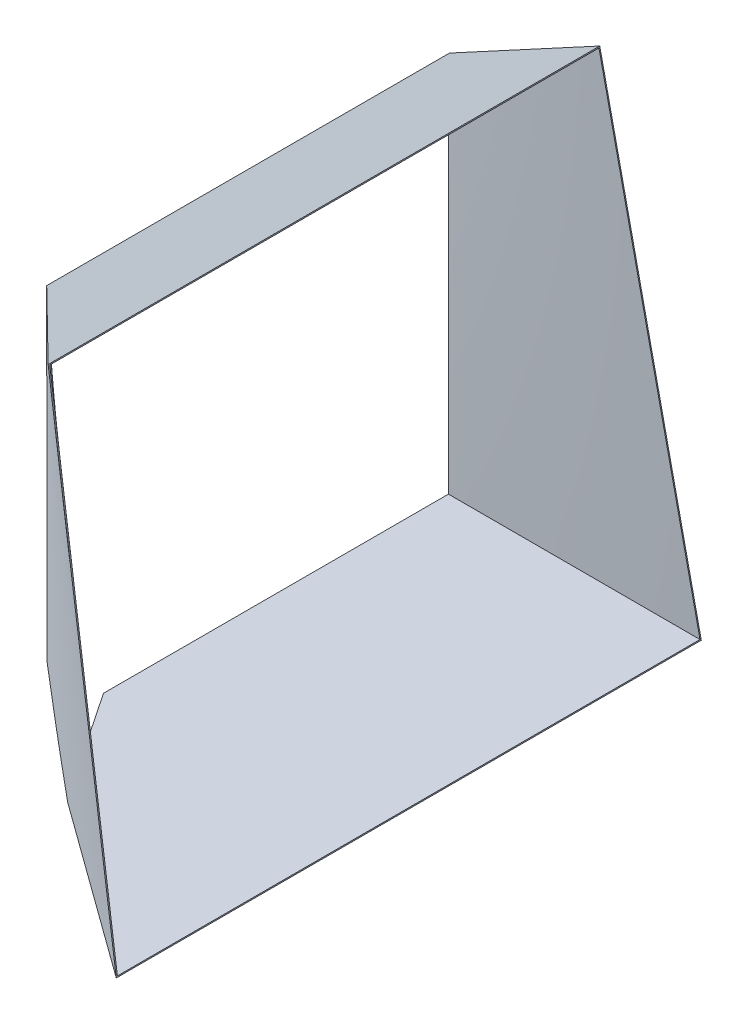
ISO-10303-21;
HEADER;
FILE_DESCRIPTION(('STEP AP214'),'2;1');
FILE_NAME('part.step','',(''),(''),'','','');
FILE_SCHEMA(('AUTOMOTIVE_DESIGN { 1 0 10303 214 1 1 1 1 }'));
ENDSEC;
DATA;
#1=APPLICATION_CONTEXT('core data for automotive mechanical design processes');
#2=APPLICATION_PROTOCOL_DEFINITION('international standard','automotive_design',2000,#1);
#3=PRODUCT_CONTEXT('',#1,'mechanical');
#4=PRODUCT('Part','Part','',(#3));
#5=PRODUCT_RELATED_PRODUCT_CATEGORY('part','',(#4));
#6=PRODUCT_DEFINITION_FORMATION('','',#4);
#7=PRODUCT_DEFINITION_CONTEXT('part definition',#1,'design');
#8=PRODUCT_DEFINITION('design','',#6,#7);
#9=PRODUCT_DEFINITION_SHAPE('','',#8);
#10=(LENGTH_UNIT() NAMED_UNIT(*) SI_UNIT(.MILLI.,.METRE.));
#11=(NAMED_UNIT(*) PLANE_ANGLE_UNIT() SI_UNIT($,.RADIAN.));
#12=(NAMED_UNIT(*) SI_UNIT($,.STERADIAN.) SOLID_ANGLE_UNIT());
#13=UNCERTAINTY_MEASURE_WITH_UNIT(LENGTH_MEASURE(1.E-05),#10,'distance_accuracy_value','');
#14=(GEOMETRIC_REPRESENTATION_CONTEXT(3) GLOBAL_UNCERTAINTY_ASSIGNED_CONTEXT((#13)) GLOBAL_UNIT_ASSIGNED_CONTEXT((#10,
#11,#12)) REPRESENTATION_CONTEXT('',''));
#15=CARTESIAN_POINT('',(0.,0.,0.));
#16=DIRECTION('',(0.,0.,1.));
#17=DIRECTION('',(1.,0.,0.));
#18=AXIS2_PLACEMENT_3D('',#15,#16,#17);
#19=CARTESIAN_POINT('',(880.883595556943,197.394847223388,234.644425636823));
#20=DIRECTION('',(1.,0.,0.));
#21=DIRECTION('',(0.,0.,-1.));
#22=AXIS2_PLACEMENT_3D('',#19,#20,#21);
#23=PLANE('',#22);
#24=DIRECTION('',(0.,0.,1.));
#25=VECTOR('',#24,1.);
#26=CARTESIAN_POINT('',(880.883595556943,197.394847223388,234.644425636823));
#27=LINE('',#26,#25);
#28=CARTESIAN_POINT('',(880.883595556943,197.394847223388,-525.355574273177));
#29=VERTEX_POINT('',#28);
#30=CARTESIAN_POINT('',(880.883595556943,197.394847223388,129.644425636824));
#31=VERTEX_POINT('',#30);
#32=EDGE_CURVE('E140',#29,#31,#27,.T.);
#33=ORIENTED_EDGE('',*,*,#32,.F.);
#34=DIRECTION('',(0.,-1.,0.));
#35=VECTOR('',#34,1.);
#36=CARTESIAN_POINT('',(880.883595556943,197.394847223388,-525.355574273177));
#37=LINE('',#36,#35);
#38=CARTESIAN_POINT('',(880.883595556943,919.394847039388,-525.355574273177));
#39=VERTEX_POINT('',#38);
#40=EDGE_CURVE('E264',#39,#29,#37,.T.);
#41=ORIENTED_EDGE('',*,*,#40,.F.);
#42=DIRECTION('',(0.,0.,-1.));
#43=VECTOR('',#42,1.);
#44=CARTESIAN_POINT('',(880.883595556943,919.394847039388,-525.355574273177));
#45=LINE('',#44,#43);
#46=CARTESIAN_POINT('',(880.883595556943,919.394847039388,234.644425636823));
#47=VERTEX_POINT('',#46);
#48=EDGE_CURVE('E138',#47,#39,#45,.T.);
#49=ORIENTED_EDGE('',*,*,#48,.F.);
#50=DIRECTION('',(0.,1.,0.));
#51=VECTOR('',#50,1.);
#52=CARTESIAN_POINT('',(880.883595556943,919.394847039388,234.644425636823));
#53=LINE('',#52,#51);
#54=CARTESIAN_POINT('',(880.883595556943,302.394847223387,234.644425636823));
#55=VERTEX_POINT('',#54);
#56=EDGE_CURVE('E124',#55,#47,#53,.T.);
#57=ORIENTED_EDGE('',*,*,#56,.F.);
#58=DIRECTION('',(0.,0.707106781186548,0.707106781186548));
#59=VECTOR('',#58,1.);
#60=CARTESIAN_POINT('',(880.883595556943,249.894847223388,182.144425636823));
#61=LINE('',#60,#59);
#62=CARTESIAN_POINT('',(880.883595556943,304.886968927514,237.13654734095));
#63=VERTEX_POINT('',#62);
#64=EDGE_CURVE('E135',#55,#63,#61,.T.);
#65=ORIENTED_EDGE('',*,*,#64,.T.);
#66=CARTESIAN_POINT('',(880.883595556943,304.886968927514,237.136547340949));
#67=CARTESIAN_POINT('',(880.883595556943,330.587160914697,237.145022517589));
#68=CARTESIAN_POINT('',(880.883595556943,356.287352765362,237.153901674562));
#69=CARTESIAN_POINT('',(880.883595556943,407.687736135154,237.172598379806));
#70=CARTESIAN_POINT('',(880.883595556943,433.387927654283,237.182415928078));
#71=CARTESIAN_POINT('',(880.883595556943,510.488500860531,237.213471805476));
#72=CARTESIAN_POINT('',(880.883595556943,561.888881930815,237.236313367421));
#73=CARTESIAN_POINT('',(880.883595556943,638.989452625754,237.274906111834));
#74=CARTESIAN_POINT('',(880.883595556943,664.689643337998,237.288492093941));
#75=CARTESIAN_POINT('',(880.883595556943,716.090023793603,237.317366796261));
#76=CARTESIAN_POINT('',(880.883595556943,741.790213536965,237.332655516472));
#77=CARTESIAN_POINT('',(880.883595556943,793.190592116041,237.365234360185));
#78=CARTESIAN_POINT('',(880.883595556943,818.890780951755,237.382524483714));
#79=CARTESIAN_POINT('',(880.883595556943,870.291156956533,237.419506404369));
#80=CARTESIAN_POINT('',(880.883595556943,895.991344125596,237.439198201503));
#81=CARTESIAN_POINT('',(880.883595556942,921.691530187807,237.460290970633));
#82=B_SPLINE_CURVE_WITH_KNOTS('',3,(#66,#67,#68,#69,#70,#71,#72,#73,#74,#75,#76,#77,#78,#79,#80,
#81),.UNSPECIFIED.,.F.,.F.,(4,2,2,2,2,2,2,4),(0.,77.100580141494,154.20116031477,
308.402318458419,385.502901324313,462.603484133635,539.704067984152,616.804652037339),.UNSPECIFIED.);
#83=CARTESIAN_POINT('',(880.883595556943,921.691530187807,237.460290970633));
#84=VERTEX_POINT('',#83);
#85=EDGE_CURVE('E151',#63,#84,#82,.T.);
#86=ORIENTED_EDGE('',*,*,#85,.T.);
#87=DIRECTION('',(0.,0.,-1.));
#88=VECTOR('',#87,1.);
#89=CARTESIAN_POINT('',(880.883595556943,921.691530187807,-509.775661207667));
#90=LINE('',#89,#88);
#91=CARTESIAN_POINT('',(880.883595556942,921.691530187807,-527.358290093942));
#92=VERTEX_POINT('',#91);
#93=EDGE_CURVE('E300',#84,#92,#90,.T.);
#94=ORIENTED_EDGE('',*,*,#93,.T.);
#95=CARTESIAN_POINT('',(880.883595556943,921.691530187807,-527.358290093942));
#96=CARTESIAN_POINT('',(880.883595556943,883.16223744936,-527.357559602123));
#97=CARTESIAN_POINT('',(880.883595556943,844.63294470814,-527.357023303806));
#98=CARTESIAN_POINT('',(880.883595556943,767.574359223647,-527.356234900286));
#99=CARTESIAN_POINT('',(880.883595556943,729.045066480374,-527.355982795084));
#100=CARTESIAN_POINT('',(880.883595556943,649.25559123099,-527.355647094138));
#101=CARTESIAN_POINT('',(880.883595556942,607.99540872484,-527.355576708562));
#102=CARTESIAN_POINT('',(880.883595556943,525.475043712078,-527.355571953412));
#103=CARTESIAN_POINT('',(880.883595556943,484.214861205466,-527.355637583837));
#104=CARTESIAN_POINT('',(880.883595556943,401.694496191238,-527.355855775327));
#105=CARTESIAN_POINT('',(880.883595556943,360.434313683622,-527.356008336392));
#106=CARTESIAN_POINT('',(880.883595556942,277.913948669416,-527.356371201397));
#107=CARTESIAN_POINT('',(880.883595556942,236.653766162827,-527.356581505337));
#108=CARTESIAN_POINT('',(880.883595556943,195.39358365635,-527.356806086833));
#109=B_SPLINE_CURVE_WITH_KNOTS('',3,(#95,#96,#97,#98,#99,#100,#101,#102,#103,#104,#105,#106,
#107,#108),.UNSPECIFIED.,.F.,.F.,(4,2,2,2,2,2,4),(0.,115.587878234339,231.17575646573,
354.956303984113,478.736851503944,602.517399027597,726.29794654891),.UNSPECIFIED.);
#110=CARTESIAN_POINT('',(880.883595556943,195.39358365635,-527.356806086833));
#111=VERTEX_POINT('',#110);
#112=EDGE_CURVE('E295',#92,#111,#109,.T.);
#113=ORIENTED_EDGE('',*,*,#112,.T.);
#114=DIRECTION('',(0.,0.,1.));
#115=VECTOR('',#114,1.);
#116=CARTESIAN_POINT('',(880.883595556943,195.39358365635,234.644425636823));
#117=LINE('',#116,#115);
#118=CARTESIAN_POINT('',(880.883595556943,195.39358365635,127.643162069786));
#119=VERTEX_POINT('',#118);
#120=EDGE_CURVE('E293',#111,#119,#117,.T.);
#121=ORIENTED_EDGE('',*,*,#120,.T.);
#122=EDGE_CURVE('E148',#119,#31,#61,.T.);
#123=ORIENTED_EDGE('',*,*,#122,.T.);
#124=EDGE_LOOP('',(#33,#41,#49,#57,#65,#86,#94,#113,#121,#123));
#125=FACE_BOUND('',#124,.T.);
#126=ADVANCED_FACE('F41',(#125),#23,.F.);
#127=CARTESIAN_POINT('',(1182.25054398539,1089.52399568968,533.064512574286));
#128=DIRECTION('',(-0.984807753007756,-0.173648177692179,0.));
#129=DIRECTION('',(0.173648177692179,-0.984807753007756,0.));
#130=AXIS2_PLACEMENT_3D('',#127,#128,#129);
#131=PLANE('',#130);
#132=CARTESIAN_POINT('',(1181.88223828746,1091.61276109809,535.719743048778));
#133=CARTESIAN_POINT('',(1190.09758456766,1045.02121710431,537.326306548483));
#134=CARTESIAN_POINT('',(1198.31292280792,998.429718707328,538.934232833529));
#135=CARTESIAN_POINT('',(1214.74358557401,905.246799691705,542.152406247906));
#136=CARTESIAN_POINT('',(1222.95891009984,858.655379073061,543.762653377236));
#137=CARTESIAN_POINT('',(1239.38954781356,765.472602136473,546.985063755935));
#138=CARTESIAN_POINT('',(1247.60486100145,718.881245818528,548.597227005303));
#139=CARTESIAN_POINT('',(1264.03547780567,625.698587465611,551.82317086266));
#140=CARTESIAN_POINT('',(1272.25078142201,579.107285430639,553.43695147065));
#141=CARTESIAN_POINT('',(1290.85600733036,473.591806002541,557.093232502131));
#142=CARTESIAN_POINT('',(1301.24592719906,414.667642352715,559.136141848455));
#143=CARTESIAN_POINT('',(1322.025756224,296.819375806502,563.223764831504));
#144=CARTESIAN_POINT('',(1332.41566538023,237.895272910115,565.268478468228));
#145=CARTESIAN_POINT('',(1342.80557030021,178.971194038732,567.313905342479));
#146=B_SPLINE_CURVE_WITH_KNOTS('',3,(#132,#133,#134,#135,#136,#137,#138,#139,#140,#141,#142,
#143,#144,#145),.UNSPECIFIED.,.F.,.F.,(4,2,2,2,2,2,4),(0.,142.012690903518,284.025381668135,
426.038072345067,568.050763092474,747.654852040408,927.258940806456),.UNSPECIFIED.);
#147=CARTESIAN_POINT('',(1181.88223828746,1091.61276109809,535.719743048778));
#148=VERTEX_POINT('',#147);
#149=CARTESIAN_POINT('',(1342.80557030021,178.971194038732,567.313905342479));
#150=VERTEX_POINT('',#149);
#151=EDGE_CURVE('E308',#148,#150,#146,.T.);
#152=ORIENTED_EDGE('',*,*,#151,.T.);
#153=DIRECTION('',(0.,0.,-1.));
#154=VECTOR('',#153,1.);
#155=CARTESIAN_POINT('',(1342.80557030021,178.971194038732,533.064512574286));
#156=LINE('',#155,#154);
#157=CARTESIAN_POINT('',(1342.80557030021,178.971194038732,-543.557840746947));
#158=VERTEX_POINT('',#157);
#159=EDGE_CURVE('E52',#150,#158,#156,.T.);
#160=ORIENTED_EDGE('',*,*,#159,.T.);
#161=CARTESIAN_POINT('',(1342.80557030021,178.971194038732,-543.557840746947));
#162=CARTESIAN_POINT('',(1329.43238600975,254.814290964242,-540.910542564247));
#163=CARTESIAN_POINT('',(1316.05920158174,330.657388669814,-538.263267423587));
#164=CARTESIAN_POINT('',(1289.31283213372,482.343587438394,-532.96881632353));
#165=CARTESIAN_POINT('',(1275.93964711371,558.186688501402,-530.321640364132));
#166=CARTESIAN_POINT('',(1249.11909245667,710.293612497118,-525.012756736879));
#167=CARTESIAN_POINT('',(1235.67172281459,786.5574354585,-522.351049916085));
#168=CARTESIAN_POINT('',(1208.77698192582,939.085090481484,-517.027905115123));
#169=CARTESIAN_POINT('',(1195.32961067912,1015.34892254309,-514.366467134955));
#170=CARTESIAN_POINT('',(1181.88223828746,1091.61276109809,-511.705221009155));
#171=B_SPLINE_CURVE_WITH_KNOTS('',3,(#161,#162,#163,#164,#165,#166,#167,#168,#169,#170),
.UNSPECIFIED.,.F.,.F.,(4,2,2,2,4),(0.,231.175756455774,462.35151291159,694.809647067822,
927.267781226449),.UNSPECIFIED.);
#172=CARTESIAN_POINT('',(1181.88223828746,1091.61276109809,-511.705221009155));
#173=VERTEX_POINT('',#172);
#174=EDGE_CURVE('E316',#158,#173,#171,.T.);
#175=ORIENTED_EDGE('',*,*,#174,.T.);
#176=DIRECTION('',(0.,0.,1.));
#177=VECTOR('',#176,1.);
#178=CARTESIAN_POINT('',(1181.88223828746,1091.61276109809,-509.775661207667));
#179=LINE('',#178,#177);
#180=EDGE_CURVE('E314',#173,#148,#179,.T.);
#181=ORIENTED_EDGE('',*,*,#180,.T.);
#182=EDGE_LOOP('',(#152,#160,#175,#181));
#183=FACE_BOUND('',#182,.T.);
#184=DIRECTION('',(0.17354569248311,-0.98422653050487,0.0343515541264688));
#185=VECTOR('',#184,1.);
#186=CARTESIAN_POINT('',(1342.45046745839,180.985082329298,564.774411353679));
#187=LINE('',#186,#185);
#188=CARTESIAN_POINT('',(1182.25054398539,1089.52399568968,533.064512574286));
#189=VERTEX_POINT('',#188);
#190=CARTESIAN_POINT('',(1342.45046745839,180.985082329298,564.774411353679));
#191=VERTEX_POINT('',#190);
#192=EDGE_CURVE('E250',#189,#191,#187,.T.);
#193=ORIENTED_EDGE('',*,*,#192,.F.);
#194=DIRECTION('',(0.,0.,1.));
#195=VECTOR('',#194,1.);
#196=CARTESIAN_POINT('',(1182.25054398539,1089.52399568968,533.064512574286));
#197=LINE('',#196,#195);
#198=CARTESIAN_POINT('',(1182.25054398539,1089.52399568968,-509.775661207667));
#199=VERTEX_POINT('',#198);
#200=EDGE_CURVE('E281',#199,#189,#197,.T.);
#201=ORIENTED_EDGE('',*,*,#200,.F.);
#202=DIRECTION('',(-0.17354569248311,0.98422653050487,0.0343515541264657));
#203=VECTOR('',#202,1.);
#204=CARTESIAN_POINT('',(1182.25054398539,1089.52399568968,-509.775661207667));
#205=LINE('',#204,#203);
#206=CARTESIAN_POINT('',(1342.45046745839,180.985082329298,-541.485559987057));
#207=VERTEX_POINT('',#206);
#208=EDGE_CURVE('E283',#207,#199,#205,.T.);
#209=ORIENTED_EDGE('',*,*,#208,.F.);
#210=DIRECTION('',(0.,0.,-1.));
#211=VECTOR('',#210,1.);
#212=CARTESIAN_POINT('',(1342.45046745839,180.985082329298,-541.485559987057));
#213=LINE('',#212,#211);
#214=EDGE_CURVE('E287',#191,#207,#213,.T.);
#215=ORIENTED_EDGE('',*,*,#214,.F.);
#216=EDGE_LOOP('',(#193,#201,#209,#215));
#217=FACE_BOUND('',#216,.T.);
#218=ADVANCED_FACE('F186',(#183,#217),#131,.F.);
#219=CARTESIAN_POINT('',(1348.76590371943,171.713716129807,568.454304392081));
#220=CARTESIAN_POINT('',(880.883595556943,190.174847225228,234.644425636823));
#221=CARTESIAN_POINT('',(1348.22646972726,174.748506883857,568.347529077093));
#222=CARTESIAN_POINT('',(880.883595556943,192.581513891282,234.644425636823));
#223=CARTESIAN_POINT('',(1347.68703573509,177.783297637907,568.240753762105));
#224=CARTESIAN_POINT('',(880.883595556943,194.988180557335,234.644425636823));
#225=CARTESIAN_POINT('',(1320.17590213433,332.557626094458,562.795212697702));
#226=CARTESIAN_POINT('',(880.883595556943,317.728180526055,234.644425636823));
#227=CARTESIAN_POINT('',(1293.20420252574,484.297163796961,557.456446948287));
#228=CARTESIAN_POINT('',(880.883595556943,438.061513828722,234.644425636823));
#229=CARTESIAN_POINT('',(1239.26080330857,787.77623920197,546.778915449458));
#230=CARTESIAN_POINT('',(880.883595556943,678.728180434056,234.644425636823));
#231=CARTESIAN_POINT('',(1212.28910369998,939.515776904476,541.440149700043));
#232=CARTESIAN_POINT('',(880.883595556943,799.061513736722,234.644425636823));
#233=CARTESIAN_POINT('',(1184.77797009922,1094.29010536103,535.99460863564));
#234=CARTESIAN_POINT('',(880.883595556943,921.801513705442,234.644425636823));
#235=CARTESIAN_POINT('',(1184.23853610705,1097.32489611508,535.887833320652));
#236=CARTESIAN_POINT('',(880.883595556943,924.208180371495,234.644425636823));
#237=CARTESIAN_POINT('',(1183.69910211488,1100.35968686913,535.781058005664));
#238=CARTESIAN_POINT('',(880.883595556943,926.614847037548,234.644425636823));
#239=B_SPLINE_SURFACE_WITH_KNOTS('',3,1,((#219,#220),(#221,#222),(#223,#224),(#225,#226),(#227,
#228),(#229,#230),(#231,#232),(#233,#234),(#235,#236),(#237,#238)),.UNSPECIFIED.,.F.,.F.,.F.,(4,
2,2,2,4),(2,2),(-0.01,0.,0.5,1.,1.01),(-0.0101764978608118,1.),.UNSPECIFIED.);
#240=OFFSET_SURFACE('',#239,2.,.F.);
#241=CARTESIAN_POINT('',(753.481187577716,402.705865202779,138.360462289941));
#242=CARTESIAN_POINT('',(758.86887118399,398.761682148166,142.730027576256));
#243=CARTESIAN_POINT('',(764.257510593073,394.789652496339,147.073221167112));
#244=CARTESIAN_POINT('',(775.035519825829,386.792946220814,155.708088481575));
#245=CARTESIAN_POINT('',(780.424889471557,382.768276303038,159.999768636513));
#246=CARTESIAN_POINT('',(791.204102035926,374.668666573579,168.533589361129));
#247=CARTESIAN_POINT('',(796.593944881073,370.593730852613,172.775733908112));
#248=CARTESIAN_POINT('',(807.373864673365,362.395779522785,181.212304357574));
#249=CARTESIAN_POINT('',(812.763941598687,358.272766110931,185.406732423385));
#250=CARTESIAN_POINT('',(823.544087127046,349.980737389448,193.749573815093));
#251=CARTESIAN_POINT('',(828.934155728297,345.811722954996,197.897988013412));
#252=CARTESIAN_POINT('',(839.714044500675,337.429652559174,206.15039152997));
#253=CARTESIAN_POINT('',(845.103864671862,333.216596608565,210.254380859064));
#254=CARTESIAN_POINT('',(855.875519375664,324.754190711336,218.413742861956));
#255=CARTESIAN_POINT('',(861.257354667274,320.50489885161,222.469174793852));
#256=CARTESIAN_POINT('',(872.02031705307,311.965989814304,230.538620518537));
#257=CARTESIAN_POINT('',(877.40144413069,307.676371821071,234.55263347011));
#258=CARTESIAN_POINT('',(888.16275332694,299.058477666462,242.540543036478));
#259=CARTESIAN_POINT('',(893.542935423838,294.730200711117,246.514438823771));
#260=CARTESIAN_POINT('',(904.302115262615,286.036578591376,254.423334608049));
#261=CARTESIAN_POINT('',(909.681112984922,281.671232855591,258.358334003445));
#262=CARTESIAN_POINT('',(920.437682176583,272.904992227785,266.190582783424));
#263=CARTESIAN_POINT('',(925.815253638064,268.50409714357,270.087831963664));
#264=CARTESIAN_POINT('',(936.568726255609,259.668211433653,277.845657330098));
#265=CARTESIAN_POINT('',(941.944627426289,255.233221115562,281.706233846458));
#266=CARTESIAN_POINT('',(952.642430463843,246.373671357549,289.35449129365));
#267=CARTESIAN_POINT('',(957.964349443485,241.949429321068,293.142516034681));
#268=CARTESIAN_POINT('',(968.606238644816,233.070029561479,300.684642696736));
#269=CARTESIAN_POINT('',(973.92620889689,228.614872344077,304.438745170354));
#270=CARTESIAN_POINT('',(984.564140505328,219.674735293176,311.91402756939));
#271=CARTESIAN_POINT('',(989.88210187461,215.18975565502,315.635207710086));
#272=CARTESIAN_POINT('',(1000.51595219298,206.191018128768,323.045591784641));
#273=CARTESIAN_POINT('',(1005.83184114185,201.677260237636,326.734795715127));
#274=CARTESIAN_POINT('',(1016.46147980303,192.621965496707,334.08212355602));
#275=CARTESIAN_POINT('',(1021.77522950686,188.080428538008,337.740247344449));
#276=CARTESIAN_POINT('',(1032.40051982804,178.970533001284,345.026264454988));
#277=CARTESIAN_POINT('',(1037.71206043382,174.402174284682,348.654157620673));
#278=CARTESIAN_POINT('',(1048.34016867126,165.2332481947,355.885492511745));
#279=CARTESIAN_POINT('',(1053.65673312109,160.632645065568,359.488893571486));
#280=CARTESIAN_POINT('',(1064.28749955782,151.406348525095,366.666959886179));
#281=CARTESIAN_POINT('',(1069.60170154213,146.780655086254,370.241625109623));
#282=CARTESIAN_POINT('',(1080.22766186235,137.505031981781,377.362948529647));
#283=CARTESIAN_POINT('',(1085.5394202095,132.855102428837,380.909606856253));
#284=CARTESIAN_POINT('',(1096.16040888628,123.531829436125,387.975608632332));
#285=CARTESIAN_POINT('',(1101.46963924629,118.858486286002,391.494952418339));
#286=CARTESIAN_POINT('',(1112.08548415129,109.48918176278,398.506985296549));
#287=CARTESIAN_POINT('',(1117.39209875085,104.793220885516,401.999674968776));
#288=CARTESIAN_POINT('',(1128.00262285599,95.3794403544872,408.959021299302));
#289=CARTESIAN_POINT('',(1133.30653244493,90.6616214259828,412.425678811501));
#290=CARTESIAN_POINT('',(1138.60916174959,85.9331490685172,415.879707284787));
#291=B_SPLINE_CURVE_WITH_KNOTS('',3,(#241,#242,#243,#244,#245,#246,#247,#248,#249,#250,#251,
#252,#253,#254,#255,#256,#257,#258,#259,#260,#261,#262,#263,#264,#265,#266,#267,#268,#269,#270,
#271,#272,#273,#274,#275,#276,#277,#278,#279,#280,#281,#282,#283,#284,#285,#286,#287,#288,#289,
#290),.UNSPECIFIED.,.F.,.F.,(4,2,2,2,2,2,2,2,2,2,2,2,2,2,2,2,2,2,2,2,2,2,2,2,4),(0.,
23.9391878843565,47.8753552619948,71.8095873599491,95.7427299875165,119.675418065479,
143.608100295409,167.507766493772,191.407917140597,215.308559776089,239.20957149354,
263.11071251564,287.011638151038,310.680315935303,334.348607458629,358.016744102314,
381.684883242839,405.353115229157,429.021469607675,452.722495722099,476.423547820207,
500.124489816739,523.825139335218,547.525271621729,571.224623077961),.UNSPECIFIED.);
#292=CARTESIAN_POINT('',(1018.95784702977,190.484726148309,335.797034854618));
#293=VERTEX_POINT('',#292);
#294=EDGE_CURVE('E146',#293,#63,#291,.F.);
#295=ORIENTED_EDGE('',*,*,#294,.F.);
#296=CARTESIAN_POINT('',(1018.95784702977,190.484726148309,335.797034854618));
#297=CARTESIAN_POINT('',(1038.20493978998,189.800447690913,349.555392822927));
#298=CARTESIAN_POINT('',(1057.45190519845,189.116173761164,363.313929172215));
#299=CARTESIAN_POINT('',(1095.94560375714,187.747634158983,390.831327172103));
#300=CARTESIAN_POINT('',(1115.19233690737,187.06336848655,404.590188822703));
#301=CARTESIAN_POINT('',(1169.16734853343,185.144432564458,443.175786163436));
#302=CARTESIAN_POINT('',(1203.89539037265,183.909770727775,468.002853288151));
#303=CARTESIAN_POINT('',(1273.35089181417,181.440467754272,517.657803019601));
#304=CARTESIAN_POINT('',(1308.07835141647,180.205826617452,542.485685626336));
#305=CARTESIAN_POINT('',(1342.80557030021,178.971194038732,567.313905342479));
#306=B_SPLINE_CURVE_WITH_KNOTS('',3,(#296,#297,#298,#299,#300,#301,#302,#303,#304,#305),
.UNSPECIFIED.,.F.,.F.,(4,2,2,2,4),(0.,71.0063453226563,142.012690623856,270.135681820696,
398.258673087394),.UNSPECIFIED.);
#307=EDGE_CURVE('E164',#293,#150,#306,.T.);
#308=ORIENTED_EDGE('',*,*,#307,.T.);
#309=ORIENTED_EDGE('',*,*,#151,.F.);
#310=CARTESIAN_POINT('',(1181.88223828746,1091.61276109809,535.719743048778));
#311=CARTESIAN_POINT('',(1166.27640756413,1082.80288095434,520.258330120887));
#312=CARTESIAN_POINT('',(1150.67070138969,1073.99307112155,504.796751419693));
#313=CARTESIAN_POINT('',(1119.4595679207,1056.37360889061,473.873222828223));
#314=CARTESIAN_POINT('',(1103.85414062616,1047.56395649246,458.411272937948));
#315=CARTESIAN_POINT('',(1053.68617106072,1019.24288811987,408.703399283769));
#316=CARTESIAN_POINT('',(1019.12423153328,999.731812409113,374.456673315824));
#317=CARTESIAN_POINT('',(967.282785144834,970.466024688,323.084637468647));
#318=CARTESIAN_POINT('',(950.002546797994,960.710899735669,305.960301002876));
#319=CARTESIAN_POINT('',(915.442631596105,941.20096680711,271.710880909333));
#320=CARTESIAN_POINT('',(898.162954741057,931.446158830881,254.585797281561));
#321=CARTESIAN_POINT('',(880.883595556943,921.691530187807,237.460290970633));
#322=B_SPLINE_CURVE_WITH_KNOTS('',3,(#310,#311,#312,#313,#314,#315,#316,#317,#318,#319,#320,
#321),.UNSPECIFIED.,.F.,.F.,(4,2,2,2,2,4),(0.,71.0063453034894,142.012690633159,299.27817246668,
377.910913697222,456.543654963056),.UNSPECIFIED.);
#323=EDGE_CURVE('E172',#148,#84,#322,.T.);
#324=ORIENTED_EDGE('',*,*,#323,.T.);
#325=ORIENTED_EDGE('',*,*,#85,.F.);
#326=EDGE_LOOP('',(#295,#308,#309,#324,#325));
#327=FACE_BOUND('',#326,.T.);
#328=ADVANCED_FACE('F181',(#327),#240,.T.);
#329=CARTESIAN_POINT('',(1181.26734365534,1091.26563776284,-509.775661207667));
#330=DIRECTION('',(-0.491600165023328,0.870821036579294,0.));
#331=DIRECTION('',(-0.870821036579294,-0.491600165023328,0.));
#332=AXIS2_PLACEMENT_3D('',#329,#330,#331);
#333=PLANE('',#332);
#334=CARTESIAN_POINT('',(1181.88223828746,1091.61276109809,-511.705221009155));
#335=CARTESIAN_POINT('',(1165.12329561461,1082.15192053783,-512.575241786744));
#336=CARTESIAN_POINT('',(1148.36435976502,1072.69108382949,-513.44543591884));
#337=CARTESIAN_POINT('',(1114.84650438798,1053.76941962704,-515.186238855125));
#338=CARTESIAN_POINT('',(1098.08758486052,1044.30859213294,-516.056847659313));
#339=CARTESIAN_POINT('',(1064.62486978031,1025.41805600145,-517.795684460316));
#340=CARTESIAN_POINT('',(1047.92107416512,1015.98834732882,-518.663910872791));
#341=CARTESIAN_POINT('',(1014.51350533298,997.12894262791,-520.400931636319));
#342=CARTESIAN_POINT('',(997.809732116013,987.699246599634,-521.269725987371));
#343=CARTESIAN_POINT('',(964.402212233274,968.839869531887,-523.007989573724));
#344=CARTESIAN_POINT('',(947.698465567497,959.410188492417,-523.877458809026));
#345=CARTESIAN_POINT('',(914.29100472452,940.550844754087,-525.617220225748));
#346=CARTESIAN_POINT('',(897.58729054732,931.121182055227,-526.487512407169));
#347=CARTESIAN_POINT('',(880.883595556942,921.691530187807,-527.358290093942));
#348=B_SPLINE_CURVE_WITH_KNOTS('',3,(#334,#335,#336,#337,#338,#339,#340,#341,#342,#343,#344,
#345,#346,#347),.UNSPECIFIED.,.F.,.F.,(4,2,2,2,2,2,4),(0.,57.7939391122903,115.587878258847,
173.191785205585,230.795692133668,288.399599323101,346.003506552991),.UNSPECIFIED.);
#349=EDGE_CURVE('E173',#173,#92,#348,.T.);
#350=ORIENTED_EDGE('',*,*,#349,.T.);
#351=ORIENTED_EDGE('',*,*,#93,.F.);
#352=ORIENTED_EDGE('',*,*,#323,.F.);
#353=ORIENTED_EDGE('',*,*,#180,.F.);
#354=EDGE_LOOP('',(#350,#351,#352,#353));
#355=FACE_BOUND('',#354,.T.);
#356=ADVANCED_FACE('F185',(#355),#333,.T.);
#357=CARTESIAN_POINT('',(880.812535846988,195.396109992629,234.644425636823));
#358=DIRECTION('',(0.035529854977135,0.999368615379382,0.));
#359=DIRECTION('',(-0.999368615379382,0.035529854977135,0.));
#360=AXIS2_PLACEMENT_3D('',#357,#358,#359);
#361=PLANE('',#360);
#362=ORIENTED_EDGE('',*,*,#307,.F.);
#363=DIRECTION('',(-0.552665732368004,0.0196485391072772,-0.833171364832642));
#364=VECTOR('',#363,1.);
#365=CARTESIAN_POINT('',(930.132228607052,193.642681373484,201.887951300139));
#366=LINE('',#365,#364);
#367=EDGE_CURVE('E12',#293,#119,#366,.T.);
#368=ORIENTED_EDGE('',*,*,#367,.T.);
#369=ORIENTED_EDGE('',*,*,#120,.F.);
#370=CARTESIAN_POINT('',(1342.80557030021,178.971194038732,-543.557840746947));
#371=CARTESIAN_POINT('',(1304.31204036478,180.339727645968,-542.208669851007));
#372=CARTESIAN_POINT('',(1265.81851663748,181.708261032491,-540.859321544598));
#373=CARTESIAN_POINT('',(1169.58472620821,185.129593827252,-537.485410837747));
#374=CARTESIAN_POINT('',(1111.84446895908,187.182392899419,-535.460578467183));
#375=CARTESIAN_POINT('',(996.363997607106,191.287989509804,-531.409681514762));
#376=CARTESIAN_POINT('',(938.623783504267,193.340787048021,-529.383616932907));
#377=CARTESIAN_POINT('',(880.883595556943,195.39358365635,-527.356806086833));
#378=B_SPLINE_CURVE_WITH_KNOTS('',3,(#370,#371,#372,#373,#374,#375,#376,#377),.UNSPECIFIED.,.F.,
.F.,(4,2,2,4),(0.,115.624413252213,289.061033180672,462.497653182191),.UNSPECIFIED.);
#379=EDGE_CURVE('E333',#158,#111,#378,.T.);
#380=ORIENTED_EDGE('',*,*,#379,.F.);
#381=ORIENTED_EDGE('',*,*,#159,.F.);
#382=EDGE_LOOP('',(#362,#368,#369,#380,#381));
#383=FACE_BOUND('',#382,.T.);
#384=ADVANCED_FACE('F178',(#383),#361,.F.);
#385=CARTESIAN_POINT('',(1183.6461942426,1100.32933020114,-509.29959209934));
#386=CARTESIAN_POINT('',(877.885946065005,924.894901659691,-525.514544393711));
#387=CARTESIAN_POINT('',(1184.18553398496,1097.29464919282,-509.406348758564));
#388=CARTESIAN_POINT('',(877.880606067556,922.494452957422,-525.513487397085));
#389=CARTESIAN_POINT('',(1184.72487372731,1094.2599681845,-509.513105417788));
#390=CARTESIAN_POINT('',(877.875266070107,920.094004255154,-525.512430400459));
#391=CARTESIAN_POINT('',(1212.23120058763,939.491236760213,-514.957695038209));
#392=CARTESIAN_POINT('',(877.602926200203,797.67112043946,-525.458523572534));
#393=CARTESIAN_POINT('',(1239.19818770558,787.757186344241,-520.295527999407));
#394=CARTESIAN_POINT('',(877.335926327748,677.648685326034,-525.405673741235));
#395=CARTESIAN_POINT('',(1293.1321619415,484.289085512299,-530.971193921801));
#396=CARTESIAN_POINT('',(876.801926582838,437.603815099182,-525.299974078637));
#397=CARTESIAN_POINT('',(1320.09914905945,332.555035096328,-536.309026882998));
#398=CARTESIAN_POINT('',(876.534926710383,317.581379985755,-525.247124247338));
#399=CARTESIAN_POINT('',(1347.60547591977,177.786303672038,-541.75361650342));
#400=CARTESIAN_POINT('',(876.262586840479,195.158496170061,-525.193217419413));
#401=CARTESIAN_POINT('',(1348.14481566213,174.751622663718,-541.860373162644));
#402=CARTESIAN_POINT('',(876.25724684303,192.758047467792,-525.192160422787));
#403=CARTESIAN_POINT('',(1348.68415540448,171.716941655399,-541.967129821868));
#404=CARTESIAN_POINT('',(876.251906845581,190.357598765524,-525.191103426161));
#405=B_SPLINE_SURFACE_WITH_KNOTS('',3,1,((#385,#386),(#387,#388),(#389,#390),(#391,#392),(#393,
#394),(#395,#396),(#397,#398),(#399,#400),(#401,#402),(#403,#404)),.UNSPECIFIED.,.F.,.F.,.F.,(4,
2,2,2,4),(2,2),(-0.01,0.,0.5,1.,1.01),(-0.01,1.01),.UNSPECIFIED.);
#406=OFFSET_SURFACE('',#405,2.,.F.);
#407=ORIENTED_EDGE('',*,*,#174,.F.);
#408=ORIENTED_EDGE('',*,*,#379,.T.);
#409=ORIENTED_EDGE('',*,*,#112,.F.);
#410=ORIENTED_EDGE('',*,*,#349,.F.);
#411=EDGE_LOOP('',(#407,#408,#409,#410));
#412=FACE_BOUND('',#411,.T.);
#413=ADVANCED_FACE('F43',(#412),#406,.T.);
#414=CARTESIAN_POINT('',(965.041712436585,360.95450530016,423.068688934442));
#415=DIRECTION('',(0.73722484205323,0.477754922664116,-0.477754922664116));
#416=DIRECTION('',(-0.543834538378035,0.839192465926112,0.));
#417=AXIS2_PLACEMENT_3D('',#414,#415,#416);
#418=PLANE('',#417);
#419=CARTESIAN_POINT('',(1013.40703906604,192.683333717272,329.430176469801));
#420=CARTESIAN_POINT('',(1009.73068362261,195.819250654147,326.893099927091));
#421=CARTESIAN_POINT('',(1006.05380679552,198.948574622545,324.348625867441));
#422=CARTESIAN_POINT('',(998.699337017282,205.193444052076,319.244794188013));
#423=CARTESIAN_POINT('',(995.021744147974,208.308990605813,316.685437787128));
#424=CARTESIAN_POINT('',(987.66582189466,214.526010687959,311.551515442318));
#425=CARTESIAN_POINT('',(983.987492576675,217.627485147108,308.976950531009));
#426=CARTESIAN_POINT('',(976.630076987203,223.816052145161,303.812270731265));
#427=CARTESIAN_POINT('',(972.950990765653,226.903145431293,301.222156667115));
#428=CARTESIAN_POINT('',(965.592039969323,233.06263052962,296.026025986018));
#429=CARTESIAN_POINT('',(961.912175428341,236.135022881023,293.420009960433));
#430=CARTESIAN_POINT('',(954.55164582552,242.264774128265,288.19170916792));
#431=CARTESIAN_POINT('',(950.870980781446,245.32213332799,285.569424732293));
#432=CARTESIAN_POINT('',(943.508774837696,251.421516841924,280.3081694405));
#433=CARTESIAN_POINT('',(939.827233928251,254.463540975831,277.669198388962));
#434=CARTESIAN_POINT('',(932.463312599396,260.53184562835,272.374217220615));
#435=CARTESIAN_POINT('',(928.780932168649,263.558125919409,269.718206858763));
#436=CARTESIAN_POINT('',(921.415316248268,269.59456275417,264.388742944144));
#437=CARTESIAN_POINT('',(917.732080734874,272.604718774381,261.715288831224));
#438=CARTESIAN_POINT('',(910.364738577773,278.608511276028,256.350516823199));
#439=CARTESIAN_POINT('',(906.680631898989,281.602146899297,253.659198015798));
#440=CARTESIAN_POINT('',(899.311530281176,287.572488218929,248.258259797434));
#441=CARTESIAN_POINT('',(895.626535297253,290.549192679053,245.54863908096));
#442=CARTESIAN_POINT('',(888.255640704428,296.485238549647,240.110638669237));
#443=CARTESIAN_POINT('',(884.56974104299,299.444578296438,237.382257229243));
#444=CARTESIAN_POINT('',(880.883595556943,302.394847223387,234.644425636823));
#445=B_SPLINE_CURVE_WITH_KNOTS('',3,(#419,#420,#421,#422,#423,#424,#425,#426,#427,#428,#429,
#430,#431,#432,#433,#434,#435,#436,#437,#438,#439,#440,#441,#442,#443,#444),.UNSPECIFIED.,.F.,
.F.,(4,2,2,2,2,2,2,2,2,2,2,2,4),(0.,16.3730475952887,32.7447725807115,49.1153984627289,
65.485164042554,81.8543245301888,98.2231527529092,114.592172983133,130.961429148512,
147.33121357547,163.701840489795,180.073647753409,196.446998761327),.UNSPECIFIED.);
#446=CARTESIAN_POINT('',(1013.40703906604,192.683333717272,329.430176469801));
#447=VERTEX_POINT('',#446);
#448=EDGE_CURVE('E120',#447,#55,#445,.T.);
#449=ORIENTED_EDGE('',*,*,#448,.F.);
#450=DIRECTION('',(-0.552665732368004,0.0196485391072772,-0.833171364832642));
#451=VECTOR('',#450,1.);
#452=CARTESIAN_POINT('',(929.232448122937,195.675934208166,202.532750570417));
#453=LINE('',#452,#451);
#454=EDGE_CURVE('E153',#447,#31,#453,.T.);
#455=ORIENTED_EDGE('',*,*,#454,.T.);
#456=ORIENTED_EDGE('',*,*,#122,.F.);
#457=ORIENTED_EDGE('',*,*,#367,.F.);
#458=ORIENTED_EDGE('',*,*,#294,.T.);
#459=ORIENTED_EDGE('',*,*,#64,.F.);
#460=EDGE_LOOP('',(#449,#455,#456,#457,#458,#459));
#461=FACE_BOUND('',#460,.T.);
#462=ADVANCED_FACE('F144',(#461),#418,.F.);
#463=CARTESIAN_POINT('',(1348.76590371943,171.713716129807,568.454304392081));
#464=CARTESIAN_POINT('',(1344.05246669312,171.899693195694,565.091510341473));
#465=CARTESIAN_POINT('',(880.883595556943,190.174847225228,234.644425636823));
#466=CARTESIAN_POINT('',(1348.22646972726,174.748506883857,568.347529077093));
#467=CARTESIAN_POINT('',(1343.51846694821,174.928156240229,564.985810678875));
#468=CARTESIAN_POINT('',(880.883595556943,192.581513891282,234.644425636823));
#469=CARTESIAN_POINT('',(1347.68703573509,177.783297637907,568.240753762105));
#470=CARTESIAN_POINT('',(1342.9844672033,177.956619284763,564.880111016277));
#471=CARTESIAN_POINT('',(880.883595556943,194.988180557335,234.644425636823));
#472=CARTESIAN_POINT('',(1347.14760174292,180.818088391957,568.133978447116));
#473=CARTESIAN_POINT('',(1342.45046745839,180.985082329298,564.774411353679));
#474=CARTESIAN_POINT('',(880.883595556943,197.394847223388,234.644425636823));
#475=CARTESIAN_POINT('',(1320.17590213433,332.557626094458,562.795212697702));
#476=CARTESIAN_POINT('',(1315.75048021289,332.408234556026,559.48942822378));
#477=CARTESIAN_POINT('',(880.883595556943,317.728180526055,234.644425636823));
#478=CARTESIAN_POINT('',(1293.20420252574,484.297163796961,557.456446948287));
#479=CARTESIAN_POINT('',(1289.05049296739,483.831386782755,554.204445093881));
#480=CARTESIAN_POINT('',(880.883595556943,438.061513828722,234.644425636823));
#481=CARTESIAN_POINT('',(1239.26080330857,787.77623920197,546.778915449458));
#482=CARTESIAN_POINT('',(1235.65051847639,786.677691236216,543.634478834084));
#483=CARTESIAN_POINT('',(880.883595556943,678.728180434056,234.644425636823));
#484=CARTESIAN_POINT('',(1212.28910369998,939.515776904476,541.440149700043));
#485=CARTESIAN_POINT('',(1208.95053123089,938.100843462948,538.349495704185));
#486=CARTESIAN_POINT('',(880.883595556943,799.061513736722,234.644425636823));
#487=CARTESIAN_POINT('',(1185.31740409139,1091.25531460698,536.101383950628));
#488=CARTESIAN_POINT('',(1182.25054398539,1089.52399568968,533.064512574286));
#489=CARTESIAN_POINT('',(880.883595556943,919.394847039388,234.644425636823));
#490=CARTESIAN_POINT('',(1184.77797009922,1094.29010536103,535.99460863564));
#491=CARTESIAN_POINT('',(1181.71654424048,1092.55245873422,532.958812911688));
#492=CARTESIAN_POINT('',(880.883595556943,921.801513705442,234.644425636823));
#493=CARTESIAN_POINT('',(1184.23853610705,1097.32489611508,535.887833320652));
#494=CARTESIAN_POINT('',(1181.18254449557,1095.58092177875,532.85311324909));
#495=CARTESIAN_POINT('',(880.883595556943,924.208180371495,234.644425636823));
#496=CARTESIAN_POINT('',(1183.69910211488,1100.35968686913,535.781058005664));
#497=CARTESIAN_POINT('',(1180.64854475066,1098.60938482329,532.747413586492));
#498=CARTESIAN_POINT('',(880.883595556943,926.614847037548,234.644425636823));
#499=B_SPLINE_SURFACE_WITH_KNOTS('',3,1,((#463,#464,#465),(#466,#467,#468),(#469,#470,#471),
(#472,#473,#474),(#475,#476,#477),(#478,#479,#480),(#481,#482,#483),(#484,#485,#486),(#487,#488,
#489),(#490,#491,#492),(#493,#494,#495),(#496,#497,#498)),.UNSPECIFIED.,.F.,.F.,.F.,(4,3,2,3,4),
(2,1,2),(-0.01,0.,0.5,1.,1.01),(-0.0101764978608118,0.,1.),.UNSPECIFIED.);
#500=DIRECTION('',(-0.659491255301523,-0.372299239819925,-0.653042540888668));
#501=VECTOR('',#500,1.);
#502=CARTESIAN_POINT('',(1031.56706977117,1004.45942136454,383.854469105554));
#503=LINE('',#502,#501);
#504=EDGE_CURVE('E249',#189,#47,#503,.T.);
#505=DIRECTION('',(0.813027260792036,-0.0289049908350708,0.581507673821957));
#506=VECTOR('',#505,1.);
#507=CARTESIAN_POINT('',(1111.66703150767,189.189964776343,399.709418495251));
#508=LINE('',#507,#506);
#509=EDGE_CURVE('E68',#447,#191,#508,.T.);
#510=ORIENTED_EDGE('',*,*,#448,.T.);
#511=ORIENTED_EDGE('',*,*,#56,.T.);
#512=ORIENTED_EDGE('',*,*,#504,.F.);
#513=ORIENTED_EDGE('',*,*,#192,.T.);
#514=ORIENTED_EDGE('',*,*,#509,.F.);
#515=EDGE_LOOP('',(#510,#511,#512,#513,#514));
#516=FACE_BOUND('',#515,.T.);
#517=ADVANCED_FACE('F122',(#516),#499,.F.);
#518=CARTESIAN_POINT('',(1182.25054398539,1089.52399568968,-509.775661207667));
#519=DIRECTION('',(-0.491600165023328,0.870821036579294,0.));
#520=DIRECTION('',(-0.870821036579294,-0.491600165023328,0.));
#521=AXIS2_PLACEMENT_3D('',#518,#519,#520);
#522=PLANE('',#521);
#523=DIRECTION('',(-0.869939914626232,-0.491102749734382,-0.0449737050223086));
#524=VECTOR('',#523,1.);
#525=CARTESIAN_POINT('',(1182.25054398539,1089.52399568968,-509.775661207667));
#526=LINE('',#525,#524);
#527=EDGE_CURVE('E60',#199,#39,#526,.T.);
#528=ORIENTED_EDGE('',*,*,#527,.F.);
#529=ORIENTED_EDGE('',*,*,#200,.T.);
#530=ORIENTED_EDGE('',*,*,#504,.T.);
#531=ORIENTED_EDGE('',*,*,#48,.T.);
#532=EDGE_LOOP('',(#528,#529,#530,#531));
#533=FACE_BOUND('',#532,.T.);
#534=ADVANCED_FACE('F195',(#533),#522,.F.);
#535=CARTESIAN_POINT('',(880.883595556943,197.394847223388,234.644425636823));
#536=DIRECTION('',(0.035529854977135,0.999368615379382,0.));
#537=DIRECTION('',(-0.999368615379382,0.035529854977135,0.));
#538=AXIS2_PLACEMENT_3D('',#535,#536,#537);
#539=PLANE('',#538);
#540=ORIENTED_EDGE('',*,*,#509,.T.);
#541=ORIENTED_EDGE('',*,*,#214,.T.);
#542=DIRECTION('',(-0.998759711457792,0.0355082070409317,0.0349028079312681));
#543=VECTOR('',#542,1.);
#544=CARTESIAN_POINT('',(1111.66703150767,189.189964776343,-533.420567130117));
#545=LINE('',#544,#543);
#546=EDGE_CURVE('E246',#207,#29,#545,.T.);
#547=ORIENTED_EDGE('',*,*,#546,.T.);
#548=ORIENTED_EDGE('',*,*,#32,.T.);
#549=ORIENTED_EDGE('',*,*,#454,.F.);
#550=EDGE_LOOP('',(#540,#541,#547,#548,#549));
#551=FACE_BOUND('',#550,.T.);
#552=ADVANCED_FACE('F226',(#551),#539,.T.);
#553=CARTESIAN_POINT('',(1183.6461942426,1100.32933020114,-509.29959209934));
#554=CARTESIAN_POINT('',(1180.64854475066,1098.60938482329,-509.458562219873));
#555=CARTESIAN_POINT('',(880.883595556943,926.614847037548,-525.355574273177));
#556=CARTESIAN_POINT('',(877.885946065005,924.894901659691,-525.514544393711));
#557=CARTESIAN_POINT('',(1184.18553398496,1097.29464919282,-509.406348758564));
#558=CARTESIAN_POINT('',(1181.18254449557,1095.58092177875,-509.564261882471));
#559=CARTESIAN_POINT('',(880.883595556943,924.208180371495,-525.355574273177));
#560=CARTESIAN_POINT('',(877.880606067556,922.494452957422,-525.513487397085));
#561=CARTESIAN_POINT('',(1184.72487372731,1094.2599681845,-509.513105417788));
#562=CARTESIAN_POINT('',(1181.71654424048,1092.55245873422,-509.669961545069));
#563=CARTESIAN_POINT('',(880.883595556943,921.801513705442,-525.355574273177));
#564=CARTESIAN_POINT('',(877.875266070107,920.094004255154,-525.512430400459));
#565=CARTESIAN_POINT('',(1185.26421346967,1091.22528717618,-509.619862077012));
#566=CARTESIAN_POINT('',(1182.25054398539,1089.52399568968,-509.775661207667));
#567=CARTESIAN_POINT('',(880.883595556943,919.394847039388,-525.355574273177));
#568=CARTESIAN_POINT('',(877.869926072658,917.693555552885,-525.511373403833));
#569=CARTESIAN_POINT('',(1212.23120058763,939.491236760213,-514.957695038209));
#570=CARTESIAN_POINT('',(1208.95053123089,938.10084346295,-515.060644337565));
#571=CARTESIAN_POINT('',(880.883595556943,799.061513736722,-525.355574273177));
#572=CARTESIAN_POINT('',(877.602926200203,797.67112043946,-525.458523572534));
#573=CARTESIAN_POINT('',(1239.19818770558,787.757186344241,-520.295527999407));
#574=CARTESIAN_POINT('',(1235.65051847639,786.677691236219,-520.345627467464));
#575=CARTESIAN_POINT('',(880.883595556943,678.728180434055,-525.355574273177));
#576=CARTESIAN_POINT('',(877.335926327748,677.648685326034,-525.405673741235));
#577=CARTESIAN_POINT('',(1293.1321619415,484.289085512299,-530.971193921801));
#578=CARTESIAN_POINT('',(1289.05049296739,483.831386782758,-530.91559372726));
#579=CARTESIAN_POINT('',(880.883595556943,438.061513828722,-525.355574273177));
#580=CARTESIAN_POINT('',(876.801926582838,437.603815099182,-525.299974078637));
#581=CARTESIAN_POINT('',(1320.09914905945,332.555035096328,-536.309026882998));
#582=CARTESIAN_POINT('',(1315.75048021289,332.408234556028,-536.200576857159));
#583=CARTESIAN_POINT('',(880.883595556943,317.728180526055,-525.355574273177));
#584=CARTESIAN_POINT('',(876.534926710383,317.581379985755,-525.247124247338));
#585=CARTESIAN_POINT('',(1347.06613617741,180.820984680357,-541.646859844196));
#586=CARTESIAN_POINT('',(1342.45046745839,180.985082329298,-541.485559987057));
#587=CARTESIAN_POINT('',(880.883595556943,197.394847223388,-525.355574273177));
#588=CARTESIAN_POINT('',(876.267926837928,197.558944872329,-525.194274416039));
#589=CARTESIAN_POINT('',(1347.60547591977,177.786303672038,-541.75361650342));
#590=CARTESIAN_POINT('',(1342.9844672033,177.956619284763,-541.591259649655));
#591=CARTESIAN_POINT('',(880.883595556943,194.988180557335,-525.355574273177));
#592=CARTESIAN_POINT('',(876.262586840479,195.158496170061,-525.193217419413));
#593=CARTESIAN_POINT('',(1348.14481566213,174.751622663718,-541.860373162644));
#594=CARTESIAN_POINT('',(1343.51846694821,174.928156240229,-541.696959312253));
#595=CARTESIAN_POINT('',(880.883595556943,192.581513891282,-525.355574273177));
#596=CARTESIAN_POINT('',(876.25724684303,192.758047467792,-525.192160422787));
#597=CARTESIAN_POINT('',(1348.68415540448,171.716941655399,-541.967129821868));
#598=CARTESIAN_POINT('',(1344.05246669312,171.899693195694,-541.802658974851));
#599=CARTESIAN_POINT('',(880.883595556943,190.174847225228,-525.355574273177));
#600=CARTESIAN_POINT('',(876.251906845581,190.357598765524,-525.191103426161));
#601=B_SPLINE_SURFACE_WITH_KNOTS('',3,1,((#553,#554,#555,#556),(#557,#558,#559,#560),(#561,#562,
#563,#564),(#565,#566,#567,#568),(#569,#570,#571,#572),(#573,#574,#575,#576),(#577,#578,#579,
#580),(#581,#582,#583,#584),(#585,#586,#587,#588),(#589,#590,#591,#592),(#593,#594,#595,#596),
(#597,#598,#599,#600)),.UNSPECIFIED.,.F.,.F.,.F.,(4,3,2,3,4),(2,1,1,2),(-0.01,0.,0.5,1.,1.01),
(-0.01,0.,1.,1.01),.UNSPECIFIED.);
#602=ORIENTED_EDGE('',*,*,#208,.T.);
#603=ORIENTED_EDGE('',*,*,#527,.T.);
#604=ORIENTED_EDGE('',*,*,#40,.T.);
#605=ORIENTED_EDGE('',*,*,#546,.F.);
#606=EDGE_LOOP('',(#602,#603,#604,#605));
#607=FACE_BOUND('',#606,.T.);
#608=ADVANCED_FACE('F196',(#607),#601,.F.);
#609=CLOSED_SHELL('',(#126,#218,#328,#356,#384,#413,#462,#517,#534,#552,#608));
#610=MANIFOLD_SOLID_BREP('B2',#609);
#611=ADVANCED_BREP_SHAPE_REPRESENTATION('',(#18,#610),#14);
#612=SHAPE_DEFINITION_REPRESENTATION(#9,#611);
ENDSEC;
END-ISO-10303-21;
